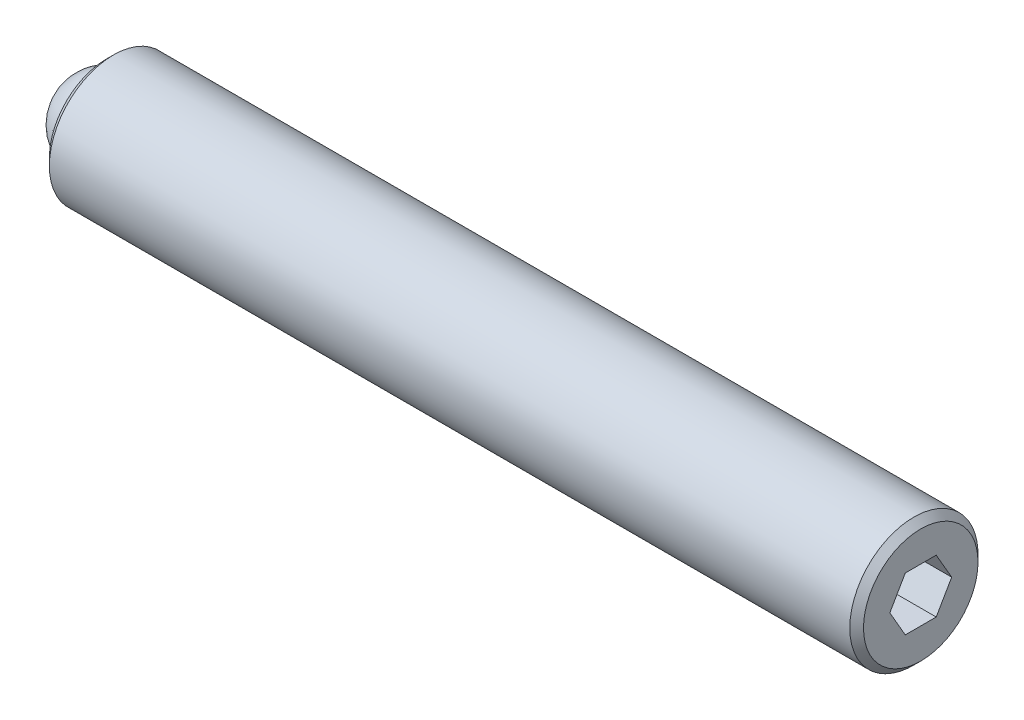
ISO-10303-21;
HEADER;
FILE_DESCRIPTION(('STEP AP214'),'2;1');
FILE_NAME('part.step','',(''),(''),'','','');
FILE_SCHEMA(('AUTOMOTIVE_DESIGN { 1 0 10303 214 1 1 1 1 }'));
ENDSEC;
DATA;
#1=APPLICATION_CONTEXT('core data for automotive mechanical design processes');
#2=APPLICATION_PROTOCOL_DEFINITION('international standard','automotive_design',2000,#1);
#3=PRODUCT_CONTEXT('',#1,'mechanical');
#4=PRODUCT('Part','Part','',(#3));
#5=PRODUCT_RELATED_PRODUCT_CATEGORY('part','',(#4));
#6=PRODUCT_DEFINITION_FORMATION('','',#4);
#7=PRODUCT_DEFINITION_CONTEXT('part definition',#1,'design');
#8=PRODUCT_DEFINITION('design','',#6,#7);
#9=PRODUCT_DEFINITION_SHAPE('','',#8);
#10=(LENGTH_UNIT() NAMED_UNIT(*) SI_UNIT(.MILLI.,.METRE.));
#11=(NAMED_UNIT(*) PLANE_ANGLE_UNIT() SI_UNIT($,.RADIAN.));
#12=(NAMED_UNIT(*) SI_UNIT($,.STERADIAN.) SOLID_ANGLE_UNIT());
#13=UNCERTAINTY_MEASURE_WITH_UNIT(LENGTH_MEASURE(1.E-05),#10,'distance_accuracy_value','');
#14=(GEOMETRIC_REPRESENTATION_CONTEXT(3) GLOBAL_UNCERTAINTY_ASSIGNED_CONTEXT((#13)) GLOBAL_UNIT_ASSIGNED_CONTEXT((#10,
#11,#12)) REPRESENTATION_CONTEXT('',''));
#15=CARTESIAN_POINT('',(0.,0.,0.));
#16=DIRECTION('',(0.,0.,1.));
#17=DIRECTION('',(1.,0.,0.));
#18=AXIS2_PLACEMENT_3D('',#15,#16,#17);
#19=CARTESIAN_POINT('',(0.,0.,0.));
#20=DIRECTION('',(0.,-1.,0.));
#21=DIRECTION('',(0.,0.,1.));
#22=AXIS2_PLACEMENT_3D('',#19,#20,#21);
#23=SPHERICAL_SURFACE('',#22,1.5875);
#24=CARTESIAN_POINT('',(0.,-1.5875,0.));
#25=VERTEX_POINT('',#24);
#26=VERTEX_LOOP('',#25);
#27=FACE_BOUND('',#26,.T.);
#28=ADVANCED_FACE('F41',(#27),#23,.T.);
#29=CLOSED_SHELL('',(#28));
#30=MANIFOLD_SOLID_BREP('B2',#29);
#31=CARTESIAN_POINT('',(30.1625,0.,0.));
#32=DIRECTION('',(-1.,0.,0.));
#33=DIRECTION('',(0.,0.,1.));
#34=AXIS2_PLACEMENT_3D('',#31,#32,#33);
#35=CYLINDRICAL_SURFACE('',#34,2.3749);
#36=CARTESIAN_POINT('',(29.9085,0.,0.));
#37=DIRECTION('',(1.,0.,0.));
#38=DIRECTION('',(0.,0.,-1.));
#39=AXIS2_PLACEMENT_3D('',#36,#37,#38);
#40=CIRCLE('',#39,2.3749);
#41=CARTESIAN_POINT('',(29.9085,0.,2.3749));
#42=VERTEX_POINT('',#41);
#43=EDGE_CURVE('E39',#42,#42,#40,.F.);
#44=CARTESIAN_POINT('',(0.254000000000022,0.,0.));
#45=DIRECTION('',(1.,0.,0.));
#46=DIRECTION('',(0.,0.,-1.));
#47=AXIS2_PLACEMENT_3D('',#44,#45,#46);
#48=CIRCLE('',#47,2.3749);
#49=CARTESIAN_POINT('',(0.254000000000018,0.,2.3749));
#50=VERTEX_POINT('',#49);
#51=EDGE_CURVE('E157',#50,#50,#48,.T.);
#52=CARTESIAN_POINT('',(29.9085,0.,2.3749));
#53=CARTESIAN_POINT('',(29.5995989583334,0.,2.3749));
#54=CARTESIAN_POINT('',(29.2906979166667,0.,2.3749));
#55=CARTESIAN_POINT('',(28.6728958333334,0.,2.3749));
#56=CARTESIAN_POINT('',(28.3639947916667,0.,2.3749));
#57=CARTESIAN_POINT('',(27.7461927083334,0.,2.3749));
#58=CARTESIAN_POINT('',(27.4372916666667,0.,2.3749));
#59=CARTESIAN_POINT('',(26.8194895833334,0.,2.3749));
#60=CARTESIAN_POINT('',(26.5105885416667,0.,2.3749));
#61=CARTESIAN_POINT('',(25.8927864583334,0.,2.3749));
#62=CARTESIAN_POINT('',(25.5838854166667,0.,2.3749));
#63=CARTESIAN_POINT('',(24.9660833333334,0.,2.3749));
#64=CARTESIAN_POINT('',(24.6571822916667,0.,2.3749));
#65=CARTESIAN_POINT('',(24.0393802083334,0.,2.3749));
#66=CARTESIAN_POINT('',(23.7304791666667,0.,2.3749));
#67=CARTESIAN_POINT('',(23.1126770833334,0.,2.3749));
#68=CARTESIAN_POINT('',(22.8037760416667,0.,2.3749));
#69=CARTESIAN_POINT('',(22.1859739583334,0.,2.3749));
#70=CARTESIAN_POINT('',(21.8770729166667,0.,2.3749));
#71=CARTESIAN_POINT('',(21.2592708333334,0.,2.3749));
#72=CARTESIAN_POINT('',(20.9503697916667,0.,2.3749));
#73=CARTESIAN_POINT('',(20.3325677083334,0.,2.3749));
#74=CARTESIAN_POINT('',(20.0236666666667,0.,2.3749));
#75=CARTESIAN_POINT('',(19.4058645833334,0.,2.3749));
#76=CARTESIAN_POINT('',(19.0969635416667,0.,2.3749));
#77=CARTESIAN_POINT('',(18.4791614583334,0.,2.3749));
#78=CARTESIAN_POINT('',(18.1702604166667,0.,2.3749));
#79=CARTESIAN_POINT('',(17.5524583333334,0.,2.3749));
#80=CARTESIAN_POINT('',(17.2435572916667,0.,2.3749));
#81=CARTESIAN_POINT('',(16.6257552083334,0.,2.3749));
#82=CARTESIAN_POINT('',(16.3168541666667,0.,2.3749));
#83=CARTESIAN_POINT('',(15.6990520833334,0.,2.3749));
#84=CARTESIAN_POINT('',(15.3901510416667,0.,2.3749));
#85=CARTESIAN_POINT('',(14.7723489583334,0.,2.3749));
#86=CARTESIAN_POINT('',(14.4634479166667,0.,2.3749));
#87=CARTESIAN_POINT('',(13.8456458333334,0.,2.3749));
#88=CARTESIAN_POINT('',(13.5367447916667,0.,2.3749));
#89=CARTESIAN_POINT('',(12.9189427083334,0.,2.3749));
#90=CARTESIAN_POINT('',(12.6100416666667,0.,2.3749));
#91=CARTESIAN_POINT('',(11.9922395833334,0.,2.3749));
#92=CARTESIAN_POINT('',(11.6833385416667,0.,2.3749));
#93=CARTESIAN_POINT('',(11.0655364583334,0.,2.3749));
#94=CARTESIAN_POINT('',(10.7566354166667,0.,2.3749));
#95=CARTESIAN_POINT('',(10.1388333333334,0.,2.3749));
#96=CARTESIAN_POINT('',(9.82993229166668,0.,2.3749));
#97=CARTESIAN_POINT('',(9.21213020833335,0.,2.3749));
#98=CARTESIAN_POINT('',(8.90322916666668,0.,2.3749));
#99=CARTESIAN_POINT('',(8.28542708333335,0.,2.3749));
#100=CARTESIAN_POINT('',(7.97652604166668,0.,2.3749));
#101=CARTESIAN_POINT('',(7.35872395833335,0.,2.3749));
#102=CARTESIAN_POINT('',(7.04982291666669,0.,2.3749));
#103=CARTESIAN_POINT('',(6.43202083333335,0.,2.3749));
#104=CARTESIAN_POINT('',(6.12311979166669,0.,2.3749));
#105=CARTESIAN_POINT('',(5.50531770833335,0.,2.3749));
#106=CARTESIAN_POINT('',(5.19641666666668,0.,2.3749));
#107=CARTESIAN_POINT('',(4.57861458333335,0.,2.3749));
#108=CARTESIAN_POINT('',(4.26971354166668,0.,2.3749));
#109=CARTESIAN_POINT('',(3.65191145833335,0.,2.3749));
#110=CARTESIAN_POINT('',(3.34301041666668,0.,2.3749));
#111=CARTESIAN_POINT('',(2.72520833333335,0.,2.3749));
#112=CARTESIAN_POINT('',(2.41630729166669,0.,2.3749));
#113=CARTESIAN_POINT('',(1.79850520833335,0.,2.3749));
#114=CARTESIAN_POINT('',(1.48960416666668,0.,2.3749));
#115=CARTESIAN_POINT('',(0.871802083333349,0.,2.3749));
#116=CARTESIAN_POINT('',(0.562901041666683,0.,2.3749));
#117=CARTESIAN_POINT('',(0.254000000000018,0.,2.3749));
#118=B_SPLINE_CURVE_WITH_KNOTS('',3,(#52,#53,#54,#55,#56,#57,#58,#59,#60,#61,#62,#63,#64,#65,
#66,#67,#68,#69,#70,#71,#72,#73,#74,#75,#76,#77,#78,#79,#80,#81,#82,#83,#84,#85,#86,#87,#88,#89,
#90,#91,#92,#93,#94,#95,#96,#97,#98,#99,#100,#101,#102,#103,#104,#105,#106,#107,#108,#109,#110,
#111,#112,#113,#114,#115,#116,#117),.UNSPECIFIED.,.F.,.F.,(4,2,2,2,2,2,2,2,2,2,2,2,2,2,2,2,2,2,
2,2,2,2,2,2,2,2,2,2,2,2,2,2,4),(0.,0.926703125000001,1.85340625,2.780109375,3.7068125,
4.633515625,5.56021875,6.486921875,7.413625,8.340328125,9.26703125,10.193734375,11.1204375,
12.047140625,12.97384375,13.900546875,14.82725,15.753953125,16.68065625,17.607359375,18.5340625,
19.460765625,20.38746875,21.314171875,22.240875,23.167578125,24.09428125,25.020984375,
25.9476875,26.874390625,27.80109375,28.727796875,29.6545),.UNSPECIFIED.);
#119=EDGE_CURVE('BSEAM54',#42,#50,#118,.T.);
#120=ORIENTED_EDGE('',*,*,#43,.T.);
#121=ORIENTED_EDGE('',*,*,#51,.T.);
#122=ORIENTED_EDGE('',*,*,#119,.T.);
#123=ORIENTED_EDGE('',*,*,#119,.F.);
#124=EDGE_LOOP('',(#120,#122,#121,#123));
#125=FACE_BOUND('',#124,.T.);
#126=ADVANCED_FACE('F54',(#125),#35,.T.);
#127=CARTESIAN_POINT('',(30.1625,0.,0.));
#128=DIRECTION('',(1.,0.,0.));
#129=DIRECTION('',(0.,0.,-1.));
#130=AXIS2_PLACEMENT_3D('',#127,#128,#129);
#131=PLANE('',#130);
#132=DIRECTION('',(0.,0.866025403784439,-0.5));
#133=VECTOR('',#132,1.);
#134=CARTESIAN_POINT('',(30.1625,-0.992187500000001,-0.572839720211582));
#135=LINE('',#134,#133);
#136=CARTESIAN_POINT('',(30.1625,-0.992187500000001,-0.572839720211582));
#137=VERTEX_POINT('',#136);
#138=CARTESIAN_POINT('',(30.1625,0.,-1.14567944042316));
#139=VERTEX_POINT('',#138);
#140=EDGE_CURVE('E69',#137,#139,#135,.T.);
#141=ORIENTED_EDGE('',*,*,#140,.F.);
#142=DIRECTION('',(0.,0.,-1.));
#143=VECTOR('',#142,1.);
#144=CARTESIAN_POINT('',(30.1625,-0.992187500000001,0.572839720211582));
#145=LINE('',#144,#143);
#146=CARTESIAN_POINT('',(30.1625,-0.992187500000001,0.572839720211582));
#147=VERTEX_POINT('',#146);
#148=EDGE_CURVE('E153',#147,#137,#145,.T.);
#149=ORIENTED_EDGE('',*,*,#148,.F.);
#150=DIRECTION('',(0.,-0.866025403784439,-0.5));
#151=VECTOR('',#150,1.);
#152=CARTESIAN_POINT('',(30.1625,0.,1.14567944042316));
#153=LINE('',#152,#151);
#154=CARTESIAN_POINT('',(30.1625,0.,1.14567944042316));
#155=VERTEX_POINT('',#154);
#156=EDGE_CURVE('E151',#155,#147,#153,.T.);
#157=ORIENTED_EDGE('',*,*,#156,.F.);
#158=DIRECTION('',(0.,-0.866025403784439,0.5));
#159=VECTOR('',#158,1.);
#160=CARTESIAN_POINT('',(30.1625,0.992187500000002,0.572839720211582));
#161=LINE('',#160,#159);
#162=CARTESIAN_POINT('',(30.1625,0.992187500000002,0.572839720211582));
#163=VERTEX_POINT('',#162);
#164=EDGE_CURVE('E117',#163,#155,#161,.T.);
#165=ORIENTED_EDGE('',*,*,#164,.F.);
#166=DIRECTION('',(0.,0.,1.));
#167=VECTOR('',#166,1.);
#168=CARTESIAN_POINT('',(30.1625,0.992187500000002,-0.572839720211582));
#169=LINE('',#168,#167);
#170=CARTESIAN_POINT('',(30.1625,0.992187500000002,-0.572839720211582));
#171=VERTEX_POINT('',#170);
#172=EDGE_CURVE('E147',#171,#163,#169,.T.);
#173=ORIENTED_EDGE('',*,*,#172,.F.);
#174=DIRECTION('',(0.,0.866025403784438,0.5));
#175=VECTOR('',#174,1.);
#176=CARTESIAN_POINT('',(30.1625,0.,-1.14567944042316));
#177=LINE('',#176,#175);
#178=EDGE_CURVE('E143',#139,#171,#177,.T.);
#179=ORIENTED_EDGE('',*,*,#178,.F.);
#180=EDGE_LOOP('',(#141,#149,#157,#165,#173,#179));
#181=FACE_BOUND('',#180,.T.);
#182=CARTESIAN_POINT('',(30.1625,0.,0.));
#183=DIRECTION('',(1.,0.,0.));
#184=DIRECTION('',(0.,0.,-1.));
#185=AXIS2_PLACEMENT_3D('',#182,#183,#184);
#186=CIRCLE('',#185,2.12090000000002);
#187=CARTESIAN_POINT('',(30.1625,0.,-2.12090000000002));
#188=VERTEX_POINT('',#187);
#189=EDGE_CURVE('E62',#188,#188,#186,.T.);
#190=ORIENTED_EDGE('',*,*,#189,.T.);
#191=EDGE_LOOP('',(#190));
#192=FACE_BOUND('',#191,.T.);
#193=ADVANCED_FACE('F170',(#181,#192),#131,.T.);
#194=CARTESIAN_POINT('',(0.,0.,0.));
#195=DIRECTION('',(1.,0.,0.));
#196=DIRECTION('',(0.,0.,-1.));
#197=AXIS2_PLACEMENT_3D('',#194,#195,#196);
#198=PLANE('',#197);
#199=CARTESIAN_POINT('',(0.,0.,0.));
#200=DIRECTION('',(-1.,0.,0.));
#201=DIRECTION('',(0.,0.,1.));
#202=AXIS2_PLACEMENT_3D('',#199,#200,#201);
#203=CIRCLE('',#202,1.5875);
#204=CARTESIAN_POINT('',(0.,0.,1.5875));
#205=VERTEX_POINT('',#204);
#206=EDGE_CURVE('E225',#205,#205,#203,.T.);
#207=ORIENTED_EDGE('',*,*,#206,.F.);
#208=EDGE_LOOP('',(#207));
#209=FACE_BOUND('',#208,.T.);
#210=CARTESIAN_POINT('',(0.,0.,0.));
#211=DIRECTION('',(1.,0.,0.));
#212=DIRECTION('',(0.,0.,-1.));
#213=AXIS2_PLACEMENT_3D('',#210,#211,#212);
#214=CIRCLE('',#213,2.12089999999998);
#215=CARTESIAN_POINT('',(0.,0.,-2.12089999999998));
#216=VERTEX_POINT('',#215);
#217=EDGE_CURVE('E165',#216,#216,#214,.F.);
#218=ORIENTED_EDGE('',*,*,#217,.T.);
#219=EDGE_LOOP('',(#218));
#220=FACE_BOUND('',#219,.T.);
#221=ADVANCED_FACE('F182',(#209,#220),#198,.F.);
#222=CARTESIAN_POINT('',(0.254000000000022,0.,0.));
#223=DIRECTION('',(1.,0.,0.));
#224=DIRECTION('',(0.,0.,-1.));
#225=AXIS2_PLACEMENT_3D('',#222,#223,#224);
#226=CONICAL_SURFACE('',#225,2.3749,0.785398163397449);
#227=ORIENTED_EDGE('',*,*,#217,.F.);
#228=EDGE_LOOP('',(#227));
#229=FACE_BOUND('',#228,.T.);
#230=ORIENTED_EDGE('',*,*,#51,.F.);
#231=EDGE_LOOP('',(#230));
#232=FACE_BOUND('',#231,.T.);
#233=ADVANCED_FACE('F174',(#229,#232),#226,.T.);
#234=CARTESIAN_POINT('',(30.1625,0.,0.));
#235=DIRECTION('',(-1.,0.,0.));
#236=DIRECTION('',(0.,0.,1.));
#237=AXIS2_PLACEMENT_3D('',#234,#235,#236);
#238=CONICAL_SURFACE('',#237,2.12090000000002,0.785398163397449);
#239=ORIENTED_EDGE('',*,*,#43,.F.);
#240=EDGE_LOOP('',(#239));
#241=FACE_BOUND('',#240,.T.);
#242=ORIENTED_EDGE('',*,*,#189,.F.);
#243=EDGE_LOOP('',(#242));
#244=FACE_BOUND('',#243,.T.);
#245=ADVANCED_FACE('F56',(#241,#244),#238,.T.);
#246=CARTESIAN_POINT('',(27.8765,-0.992187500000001,-0.572839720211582));
#247=DIRECTION('',(0.,-0.5,-0.866025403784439));
#248=DIRECTION('',(0.,0.866025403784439,-0.5));
#249=AXIS2_PLACEMENT_3D('',#246,#247,#248);
#250=PLANE('',#249);
#251=ORIENTED_EDGE('',*,*,#140,.T.);
#252=DIRECTION('',(1.,0.,0.));
#253=VECTOR('',#252,1.);
#254=CARTESIAN_POINT('',(27.8765,0.,-1.14567944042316));
#255=LINE('',#254,#253);
#256=CARTESIAN_POINT('',(27.8765,0.,-1.14567944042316));
#257=VERTEX_POINT('',#256);
#258=EDGE_CURVE('E99',#257,#139,#255,.T.);
#259=ORIENTED_EDGE('',*,*,#258,.F.);
#260=DIRECTION('',(0.,0.866025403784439,-0.5));
#261=VECTOR('',#260,1.);
#262=CARTESIAN_POINT('',(27.8765,-0.992187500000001,-0.572839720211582));
#263=LINE('',#262,#261);
#264=CARTESIAN_POINT('',(27.8765,-0.992187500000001,-0.572839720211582));
#265=VERTEX_POINT('',#264);
#266=EDGE_CURVE('E155',#265,#257,#263,.T.);
#267=ORIENTED_EDGE('',*,*,#266,.F.);
#268=DIRECTION('',(1.,0.,0.));
#269=VECTOR('',#268,1.);
#270=CARTESIAN_POINT('',(27.8765,-0.992187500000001,-0.572839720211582));
#271=LINE('',#270,#269);
#272=EDGE_CURVE('E77',#265,#137,#271,.T.);
#273=ORIENTED_EDGE('',*,*,#272,.T.);
#274=EDGE_LOOP('',(#251,#259,#267,#273));
#275=FACE_BOUND('',#274,.T.);
#276=ADVANCED_FACE('F173',(#275),#250,.F.);
#277=CARTESIAN_POINT('',(27.8765,-0.992187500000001,0.572839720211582));
#278=DIRECTION('',(0.,-1.,0.));
#279=DIRECTION('',(0.,0.,-1.));
#280=AXIS2_PLACEMENT_3D('',#277,#278,#279);
#281=PLANE('',#280);
#282=ORIENTED_EDGE('',*,*,#148,.T.);
#283=ORIENTED_EDGE('',*,*,#272,.F.);
#284=DIRECTION('',(0.,0.,-1.));
#285=VECTOR('',#284,1.);
#286=CARTESIAN_POINT('',(27.8765,-0.992187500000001,0.572839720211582));
#287=LINE('',#286,#285);
#288=CARTESIAN_POINT('',(27.8765,-0.992187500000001,0.572839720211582));
#289=VERTEX_POINT('',#288);
#290=EDGE_CURVE('E129',#289,#265,#287,.T.);
#291=ORIENTED_EDGE('',*,*,#290,.F.);
#292=DIRECTION('',(1.,0.,0.));
#293=VECTOR('',#292,1.);
#294=CARTESIAN_POINT('',(27.8765,-0.992187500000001,0.572839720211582));
#295=LINE('',#294,#293);
#296=EDGE_CURVE('E121',#289,#147,#295,.T.);
#297=ORIENTED_EDGE('',*,*,#296,.T.);
#298=EDGE_LOOP('',(#282,#283,#291,#297));
#299=FACE_BOUND('',#298,.T.);
#300=ADVANCED_FACE('F180',(#299),#281,.F.);
#301=CARTESIAN_POINT('',(27.8765,0.,1.14567944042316));
#302=DIRECTION('',(0.,-0.5,0.866025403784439));
#303=DIRECTION('',(0.,-0.866025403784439,-0.5));
#304=AXIS2_PLACEMENT_3D('',#301,#302,#303);
#305=PLANE('',#304);
#306=ORIENTED_EDGE('',*,*,#156,.T.);
#307=ORIENTED_EDGE('',*,*,#296,.F.);
#308=DIRECTION('',(0.,-0.866025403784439,-0.5));
#309=VECTOR('',#308,1.);
#310=CARTESIAN_POINT('',(27.8765,0.,1.14567944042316));
#311=LINE('',#310,#309);
#312=CARTESIAN_POINT('',(27.8765,0.,1.14567944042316));
#313=VERTEX_POINT('',#312);
#314=EDGE_CURVE('E125',#313,#289,#311,.T.);
#315=ORIENTED_EDGE('',*,*,#314,.F.);
#316=DIRECTION('',(1.,0.,0.));
#317=VECTOR('',#316,1.);
#318=CARTESIAN_POINT('',(27.8765,0.,1.14567944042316));
#319=LINE('',#318,#317);
#320=EDGE_CURVE('E110',#313,#155,#319,.T.);
#321=ORIENTED_EDGE('',*,*,#320,.T.);
#322=EDGE_LOOP('',(#306,#307,#315,#321));
#323=FACE_BOUND('',#322,.T.);
#324=ADVANCED_FACE('F126',(#323),#305,.F.);
#325=CARTESIAN_POINT('',(27.8765,0.992187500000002,0.572839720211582));
#326=DIRECTION('',(0.,0.5,0.866025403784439));
#327=DIRECTION('',(0.,-0.866025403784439,0.5));
#328=AXIS2_PLACEMENT_3D('',#325,#326,#327);
#329=PLANE('',#328);
#330=ORIENTED_EDGE('',*,*,#164,.T.);
#331=ORIENTED_EDGE('',*,*,#320,.F.);
#332=DIRECTION('',(0.,-0.866025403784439,0.5));
#333=VECTOR('',#332,1.);
#334=CARTESIAN_POINT('',(27.8765,0.992187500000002,0.572839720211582));
#335=LINE('',#334,#333);
#336=CARTESIAN_POINT('',(27.8765,0.992187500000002,0.572839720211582));
#337=VERTEX_POINT('',#336);
#338=EDGE_CURVE('E114',#337,#313,#335,.T.);
#339=ORIENTED_EDGE('',*,*,#338,.F.);
#340=DIRECTION('',(1.,0.,0.));
#341=VECTOR('',#340,1.);
#342=CARTESIAN_POINT('',(27.8765,0.992187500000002,0.572839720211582));
#343=LINE('',#342,#341);
#344=EDGE_CURVE('E122',#337,#163,#343,.T.);
#345=ORIENTED_EDGE('',*,*,#344,.T.);
#346=EDGE_LOOP('',(#330,#331,#339,#345));
#347=FACE_BOUND('',#346,.T.);
#348=ADVANCED_FACE('F112',(#347),#329,.F.);
#349=CARTESIAN_POINT('',(27.8765,0.992187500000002,-0.572839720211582));
#350=DIRECTION('',(0.,1.,0.));
#351=DIRECTION('',(0.,0.,1.));
#352=AXIS2_PLACEMENT_3D('',#349,#350,#351);
#353=PLANE('',#352);
#354=ORIENTED_EDGE('',*,*,#172,.T.);
#355=ORIENTED_EDGE('',*,*,#344,.F.);
#356=DIRECTION('',(0.,0.,1.));
#357=VECTOR('',#356,1.);
#358=CARTESIAN_POINT('',(27.8765,0.992187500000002,-0.572839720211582));
#359=LINE('',#358,#357);
#360=CARTESIAN_POINT('',(27.8765,0.992187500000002,-0.572839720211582));
#361=VERTEX_POINT('',#360);
#362=EDGE_CURVE('E135',#361,#337,#359,.T.);
#363=ORIENTED_EDGE('',*,*,#362,.F.);
#364=DIRECTION('',(1.,0.,0.));
#365=VECTOR('',#364,1.);
#366=CARTESIAN_POINT('',(27.8765,0.992187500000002,-0.572839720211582));
#367=LINE('',#366,#365);
#368=EDGE_CURVE('E160',#361,#171,#367,.T.);
#369=ORIENTED_EDGE('',*,*,#368,.T.);
#370=EDGE_LOOP('',(#354,#355,#363,#369));
#371=FACE_BOUND('',#370,.T.);
#372=ADVANCED_FACE('F201',(#371),#353,.F.);
#373=CARTESIAN_POINT('',(27.8765,0.,-1.14567944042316));
#374=DIRECTION('',(0.,0.5,-0.866025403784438));
#375=DIRECTION('',(0.,0.866025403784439,0.5));
#376=AXIS2_PLACEMENT_3D('',#373,#374,#375);
#377=PLANE('',#376);
#378=ORIENTED_EDGE('',*,*,#178,.T.);
#379=ORIENTED_EDGE('',*,*,#368,.F.);
#380=DIRECTION('',(0.,0.866025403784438,0.5));
#381=VECTOR('',#380,1.);
#382=CARTESIAN_POINT('',(27.8765,0.,-1.14567944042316));
#383=LINE('',#382,#381);
#384=EDGE_CURVE('E137',#257,#361,#383,.T.);
#385=ORIENTED_EDGE('',*,*,#384,.F.);
#386=ORIENTED_EDGE('',*,*,#258,.T.);
#387=EDGE_LOOP('',(#378,#379,#385,#386));
#388=FACE_BOUND('',#387,.T.);
#389=ADVANCED_FACE('F198',(#388),#377,.F.);
#390=CARTESIAN_POINT('',(27.8765,0.,0.));
#391=DIRECTION('',(1.,0.,0.));
#392=DIRECTION('',(0.,0.,-1.));
#393=AXIS2_PLACEMENT_3D('',#390,#391,#392);
#394=PLANE('',#393);
#395=ORIENTED_EDGE('',*,*,#266,.T.);
#396=ORIENTED_EDGE('',*,*,#384,.T.);
#397=ORIENTED_EDGE('',*,*,#362,.T.);
#398=ORIENTED_EDGE('',*,*,#338,.T.);
#399=ORIENTED_EDGE('',*,*,#314,.T.);
#400=ORIENTED_EDGE('',*,*,#290,.T.);
#401=EDGE_LOOP('',(#395,#396,#397,#398,#399,#400));
#402=FACE_BOUND('',#401,.T.);
#403=ADVANCED_FACE('F132',(#402),#394,.T.);
#404=CARTESIAN_POINT('',(1.5875,0.,0.));
#405=DIRECTION('',(-1.,0.,0.));
#406=DIRECTION('',(0.,0.,1.));
#407=AXIS2_PLACEMENT_3D('',#404,#405,#406);
#408=CYLINDRICAL_SURFACE('',#407,1.5875);
#409=CARTESIAN_POINT('',(1.5875,0.,0.));
#410=DIRECTION('',(-1.,0.,0.));
#411=DIRECTION('',(0.,0.,1.));
#412=AXIS2_PLACEMENT_3D('',#409,#410,#411);
#413=CIRCLE('',#412,1.5875);
#414=CARTESIAN_POINT('',(1.5875,0.,1.5875));
#415=VERTEX_POINT('',#414);
#416=EDGE_CURVE('E144',#415,#415,#413,.T.);
#417=ORIENTED_EDGE('',*,*,#416,.F.);
#418=EDGE_LOOP('',(#417));
#419=FACE_BOUND('',#418,.T.);
#420=ORIENTED_EDGE('',*,*,#206,.T.);
#421=EDGE_LOOP('',(#420));
#422=FACE_BOUND('',#421,.T.);
#423=ADVANCED_FACE('F214',(#419,#422),#408,.F.);
#424=CARTESIAN_POINT('',(1.5875,0.,0.));
#425=DIRECTION('',(-1.,0.,0.));
#426=DIRECTION('',(0.,0.,1.));
#427=AXIS2_PLACEMENT_3D('',#424,#425,#426);
#428=PLANE('',#427);
#429=ORIENTED_EDGE('',*,*,#416,.T.);
#430=EDGE_LOOP('',(#429));
#431=FACE_BOUND('',#430,.T.);
#432=ADVANCED_FACE('F217',(#431),#428,.T.);
#433=CLOSED_SHELL('',(#126,#193,#221,#233,#245,#276,#300,#324,#348,#372,#389,#403,#423,#432));
#434=MANIFOLD_SOLID_BREP('B6',#433);
#435=ADVANCED_BREP_SHAPE_REPRESENTATION('',(#18,#30,#434),#14);
#436=SHAPE_DEFINITION_REPRESENTATION(#9,#435);
ENDSEC;
END-ISO-10303-21;
